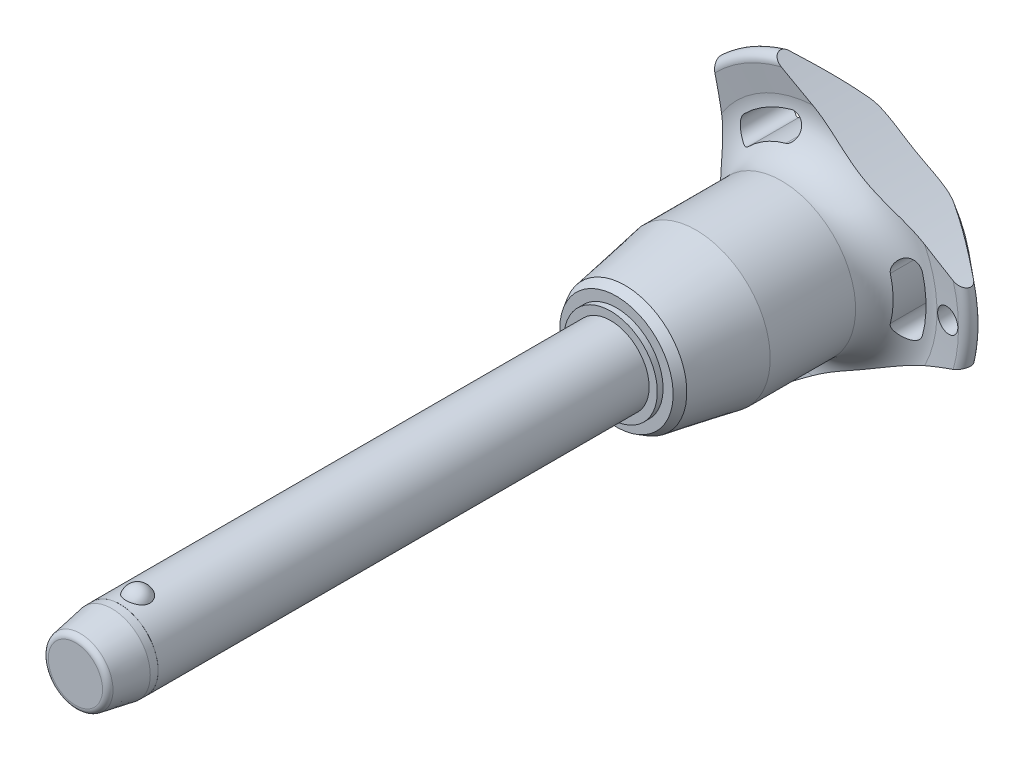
from build123d import *

# Parameters (mm, degrees)
SKETCH1_R           = 5
BOSS_EXTRUDE1_DEPTH = 60
SKETCH2_R           = 4.25
BOSS_EXTRUDE2_DEPTH = 33.3
BOSS_EXTRUDE3_START = 9.6
SKETCH1_2_R         = 5
BOSS_EXTRUDE3_DEPTH = 9.6
CHAMFER1_SIZE       = 4.8
CHAMFER1_SIZE2      = 0.846369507
FILLET1_R           = 0.75
SKETCH6_R           = 102.8
CUT_EXTRUDE1_DEPTH  = 98.333870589
CIRPATTERN1_COUNT   = 3
SKETCH7_R           = 1.5
CUT_EXTRUDE2_DEPTH  = 98.167560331
SKETCH8_R           = 5
SKETCH8_R_2         = 4.99
CUT_EXTRUDE3_DEPTH  = 5.76


with BuildPart() as part:
    # Sketch1 → Boss-Extrude1 (new body)
    with BuildSketch(Plane.XY):
        Circle(SKETCH1_R)
    extrude(amount=-BOSS_EXTRUDE1_DEPTH)

    # Sketch2 → Boss-Extrude2 (add)
    with BuildSketch(Plane(origin=(0, 0, -60), x_dir=(-1, 0, 0), z_dir=(0, 0, -1))):
        Circle(SKETCH2_R)
    extrude(amount=BOSS_EXTRUDE2_DEPTH)

    # Sketch3 → Revolve1 (revolve)
    with BuildSketch(Plane(origin=(0, 0, 0), x_dir=(0, 0, -1), z_dir=(1, 0, 0))):
        with BuildLine():
            Line((-1.516575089, 6), (-1.516575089, 2.7))
            ThreePointArc((-1.516575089, 2.7), (0.133424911, 4.35), (-1.516575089, 6))
        make_face()
        with BuildLine():
            Line((-1.516575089, -2.7), (-1.516575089, -6))
            ThreePointArc((-1.516575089, -6), (0.133424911, -4.35), (-1.516575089, -2.7))
        make_face()
    revolve(axis=Axis((0, -2.7, 1.516575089), (0, 1, 0)))

    # Sketch1_2 → Boss-Extrude3 (add)
    with BuildSketch(Plane.XY.offset(BOSS_EXTRUDE3_START)):
        Circle(SKETCH1_2_R)
    extrude(amount=-BOSS_EXTRUDE3_DEPTH)

    # Chamfer1
    chamfer1_edges = [part.edges().sort_by_distance(p)[0] for p in [
        (-5, 0, 9.6),
    ]]
    chamfer1_side = [part.faces().sort_by_distance(p)[0] for p in [
        (-5, 0, -25.2),
    ]]
    chamfer(chamfer1_edges, length=CHAMFER1_SIZE, length2=CHAMFER1_SIZE2, reference=chamfer1_side[0])

    # Fillet1
    fillet1_edges = [part.edges().sort_by_distance(p)[0] for p in [
        (-4.153630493, 0, 9.6),
        (4.25, 0, -93.3),
    ]]
    fillet(fillet1_edges, radius=FILLET1_R)

    # Sketch4 → Revolve2 (revolve)
    with BuildSketch(Plane(origin=(0, 0, 0), x_dir=(0, 0, -1), z_dir=(1, 0, 0)), mode=Mode.PRIVATE) as revolve2_sk:
        Polygon((60, 0), (60, 6.067402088), (60.75, 6.067402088), (60.75, 7.371950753), (61.879772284, 8.024225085), (71.1, 9.65), (82.2, 9.65), (82.2, 0), align=None)
    revolve(revolve2_sk.sketch.rotate(Axis((0, 0, -82.2), (0, 0, 1)), 90), axis=Axis((0, 0, -82.2), (0, 0, 1)))

    # Sketch5 → Revolve3 (revolve)
    with BuildSketch(Plane(origin=(0, 0, 0), x_dir=(0, 0, -1), z_dir=(1, 0, 0)), mode=Mode.PRIVATE) as revolve3_sk:
        with BuildLine():
            Line((87.16082631, 15.274661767), (86.757834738, 18.475067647))
            ThreePointArc((86.757834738, 18.475067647), (87.349836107, 19.516443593), (88.516044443, 19.24278761))
            Line((88.516044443, 19.24278761), (92.835691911, 14.094832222))
            ThreePointArc((92.835691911, 14.094832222), (93.3, 12.689260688), (92.67067517, 11.349423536))
            ThreePointArc((92.67067517, 11.349423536), (89.033110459, 6.185112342), (87.75, 0))
            Line((87.75, 0), (82.2, 0))
            Line((82.2, 0), (82.2, 9.65))
            ThreePointArc((82.2, 9.65), (85.949887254, 11.342683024), (87.16082631, 15.274661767))
        make_face()
    revolve(revolve3_sk.sketch.rotate(Axis((0, 0, -87.75), (0, 0, 1)), 90), axis=Axis((0, 0, -87.75), (0, 0, 1)))

    # Sketch6 → Cut-Extrude1 (cut, through all)
    with BuildSketch(Plane.XY):
        with Locations((-115.2, 0)):
            Circle(SKETCH6_R)
        with BuildLine():
            ThreePointArc((13.411913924, -3.529271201), (13.868496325, 0), (13.411913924, 3.529271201))
            ThreePointArc((13.411913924, 3.529271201), (11.694200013, 4.531299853), (10.692171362, 2.813585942))
            ThreePointArc((10.692171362, 2.813585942), (11.056165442, 0), (10.692171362, -2.813585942))
            ThreePointArc((10.692171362, -2.813585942), (11.694200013, -4.531299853), (13.411913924, -3.529271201))
        make_face()
    cut_extrude1 = extrude(amount=-CUT_EXTRUDE1_DEPTH, mode=Mode.SUBTRACT)

    # CirPattern1: Cut-Extrude1 ×3 about axis
    cirpattern1_axis = Axis((0, 0, 0), (0, 0, 1))
    for i in range(1, CIRPATTERN1_COUNT):
        add(cut_extrude1.rotate(cirpattern1_axis, i * 360 / CIRPATTERN1_COUNT), mode=Mode.SUBTRACT)

    # Sketch7 → Cut-Extrude2 (cut, through all)
    with BuildSketch(Plane.XY):
        with Locations(Location((16.868496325, 0, 0), (0, 0, 225.467095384))):
            Circle(SKETCH7_R)
    extrude(amount=-CUT_EXTRUDE2_DEPTH, mode=Mode.SUBTRACT)

    # Sketch8 → Cut-Extrude3 (cut)
    with BuildSketch(Plane.XY.offset(9.6)):
        Circle(SKETCH8_R)
        Circle(SKETCH8_R_2, mode=Mode.SUBTRACT)
    extrude(amount=-CUT_EXTRUDE3_DEPTH, mode=Mode.SUBTRACT)


solid = part.part
